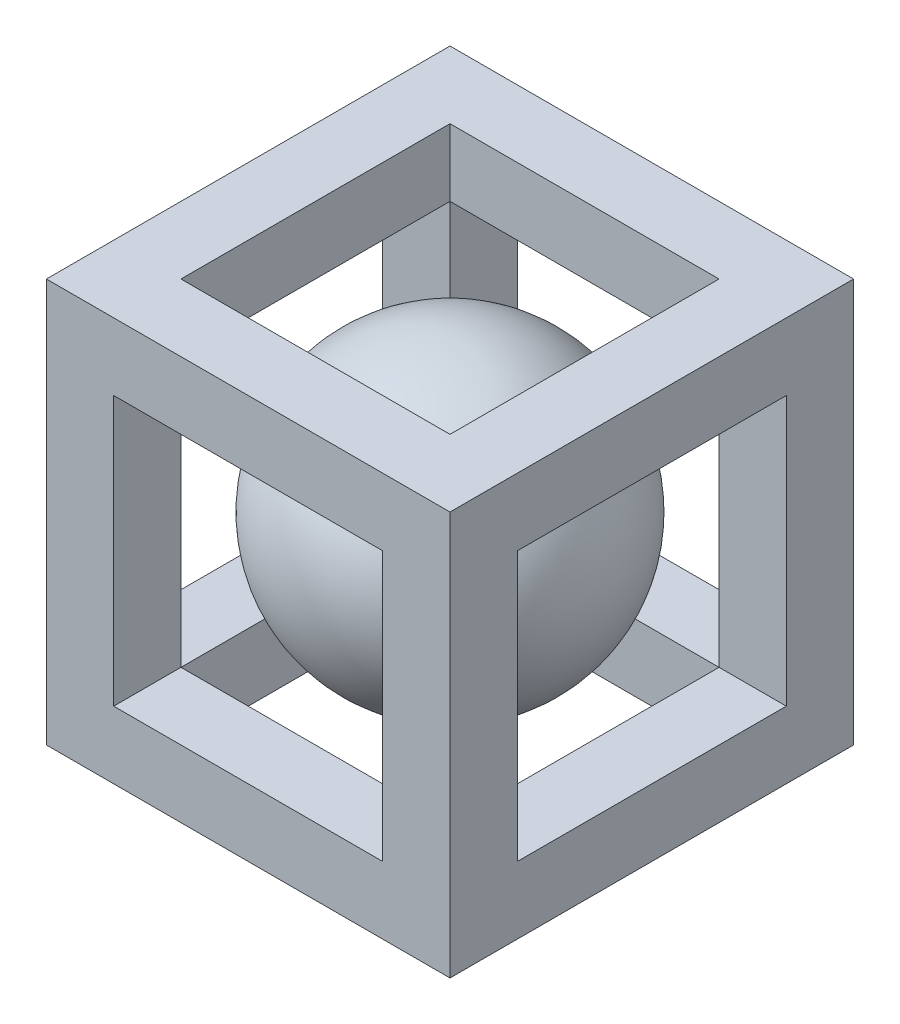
from build123d import *

# Parameters (mm, degrees)
CROQUIS1_W                 = 60
CROQUIS1_H                 = 60
CROQUIS1_W_2               = 40
CROQUIS1_H_2               = 40
SALIENTE_EXTRUIR1_DEPTH    = 60
CROQUIS2_W                 = 40
CROQUIS2_H                 = 40
CORTAR_EXTRUIR1_DEPTH      = 104.923048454
CORTAR_EXTRUIR2_DEPTH      = 60
CORTAR_EXTRUIR2_DEPTH_BACK = 91
CROQUIS3_W                 = 40
CROQUIS3_H                 = 40


with BuildPart() as part:
    # Croquis1 → Saliente-Extruir1 (new body)
    with BuildSketch(Plane.XY):
        with Locations((-30, 30)):
            Rectangle(CROQUIS1_W, CROQUIS1_H)
        with Locations((-30, 30)):
            Rectangle(CROQUIS1_W_2, CROQUIS1_H_2, mode=Mode.SUBTRACT)
    extrude(amount=SALIENTE_EXTRUIR1_DEPTH)

    # Croquis2 → Cortar-Extruir1 (cut, through all)
    with BuildSketch(Plane(origin=(0, 60, 0), x_dir=(1, 0, 0), z_dir=(0, 1, 0))):
        with Locations((-30, -30)):
            Rectangle(CROQUIS2_W, CROQUIS2_H)
    extrude(amount=-CORTAR_EXTRUIR1_DEPTH, mode=Mode.SUBTRACT)

    # Croquis3 → Cortar-Extruir2 (cut, two sides: drawn at the far end of the back side and taken through both)
    with BuildSketch(Plane(origin=(-30, 0, 0), x_dir=(0, 0, -1), z_dir=(1, 0, 0)).offset(-CORTAR_EXTRUIR2_DEPTH_BACK)):
        with Locations((-30, 30)):
            Rectangle(CROQUIS3_W, CROQUIS3_H)
    extrude(amount=CORTAR_EXTRUIR2_DEPTH + CORTAR_EXTRUIR2_DEPTH_BACK, mode=Mode.SUBTRACT)


with BuildPart() as body_2:
    # Croquis4 → Revoluci_n1 (revolve)
    with BuildSketch(Plane(origin=(-30, 0, 0), x_dir=(0, 0, -1), z_dir=(1, 0, 0))):
        with BuildLine():
            Line((-30, 52.5), (-30, 7.5))
            ThreePointArc((-30, 7.5), (-7.5, 30), (-30, 52.5))
        make_face()
    revolve(axis=Axis((-30, 50, 30), (0, -1, 0)))


solid = Compound([part.part, body_2.part])
